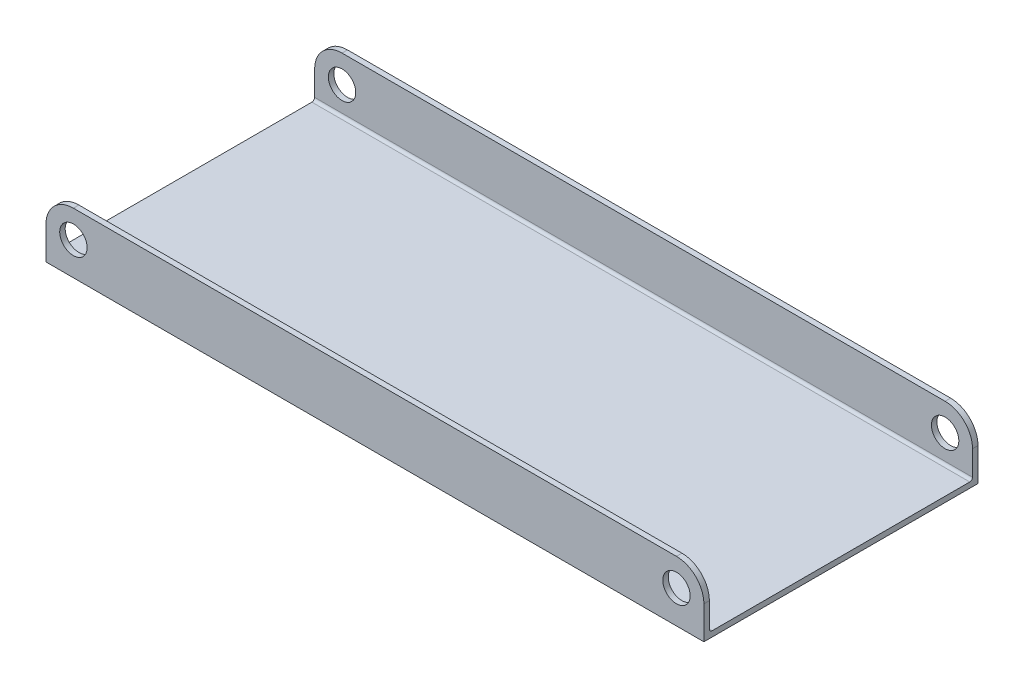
ISO-10303-21;
HEADER;
FILE_DESCRIPTION(('STEP AP214'),'2;1');
FILE_NAME('part.step','',(''),(''),'','','');
FILE_SCHEMA(('AUTOMOTIVE_DESIGN { 1 0 10303 214 1 1 1 1 }'));
ENDSEC;
DATA;
#1=APPLICATION_CONTEXT('core data for automotive mechanical design processes');
#2=APPLICATION_PROTOCOL_DEFINITION('international standard','automotive_design',2000,#1);
#3=PRODUCT_CONTEXT('',#1,'mechanical');
#4=PRODUCT('Part','Part','',(#3));
#5=PRODUCT_RELATED_PRODUCT_CATEGORY('part','',(#4));
#6=PRODUCT_DEFINITION_FORMATION('','',#4);
#7=PRODUCT_DEFINITION_CONTEXT('part definition',#1,'design');
#8=PRODUCT_DEFINITION('design','',#6,#7);
#9=PRODUCT_DEFINITION_SHAPE('','',#8);
#10=(LENGTH_UNIT() NAMED_UNIT(*) SI_UNIT(.MILLI.,.METRE.));
#11=(NAMED_UNIT(*) PLANE_ANGLE_UNIT() SI_UNIT($,.RADIAN.));
#12=(NAMED_UNIT(*) SI_UNIT($,.STERADIAN.) SOLID_ANGLE_UNIT());
#13=UNCERTAINTY_MEASURE_WITH_UNIT(LENGTH_MEASURE(1.E-05),#10,'distance_accuracy_value','');
#14=(GEOMETRIC_REPRESENTATION_CONTEXT(3) GLOBAL_UNCERTAINTY_ASSIGNED_CONTEXT((#13)) GLOBAL_UNIT_ASSIGNED_CONTEXT((#10,
#11,#12)) REPRESENTATION_CONTEXT('',''));
#15=CARTESIAN_POINT('',(0.,0.,0.));
#16=DIRECTION('',(0.,0.,1.));
#17=DIRECTION('',(1.,0.,0.));
#18=AXIS2_PLACEMENT_3D('',#15,#16,#17);
#19=CARTESIAN_POINT('',(0.,1.905,-1.905));
#20=DIRECTION('',(-1.,0.,0.));
#21=DIRECTION('',(0.,0.,1.));
#22=AXIS2_PLACEMENT_3D('',#19,#20,#21);
#23=CYLINDRICAL_SURFACE('',#22,0.635);
#24=DIRECTION('',(1.,0.,0.));
#25=VECTOR('',#24,1.);
#26=CARTESIAN_POINT('',(0.,1.27,-1.905));
#27=LINE('',#26,#25);
#28=CARTESIAN_POINT('',(0.,1.27,-1.905));
#29=VERTEX_POINT('',#28);
#30=CARTESIAN_POINT('',(152.4,1.27,-1.905));
#31=VERTEX_POINT('',#30);
#32=EDGE_CURVE('E193',#29,#31,#27,.T.);
#33=ORIENTED_EDGE('',*,*,#32,.F.);
#34=CARTESIAN_POINT('',(0.,1.905,-1.905));
#35=DIRECTION('',(-1.,0.,0.));
#36=DIRECTION('',(0.,0.,1.));
#37=AXIS2_PLACEMENT_3D('',#34,#35,#36);
#38=CIRCLE('',#37,0.635);
#39=CARTESIAN_POINT('',(0.,1.905,-1.27));
#40=VERTEX_POINT('',#39);
#41=EDGE_CURVE('E44',#29,#40,#38,.T.);
#42=ORIENTED_EDGE('',*,*,#41,.T.);
#43=DIRECTION('',(1.,0.,0.));
#44=VECTOR('',#43,1.);
#45=CARTESIAN_POINT('',(0.,1.905,-1.27));
#46=LINE('',#45,#44);
#47=CARTESIAN_POINT('',(152.4,1.905,-1.27));
#48=VERTEX_POINT('',#47);
#49=EDGE_CURVE('E196',#48,#40,#46,.F.);
#50=ORIENTED_EDGE('',*,*,#49,.F.);
#51=CARTESIAN_POINT('',(152.4,1.905,-1.905));
#52=DIRECTION('',(-1.,0.,0.));
#53=DIRECTION('',(0.,0.,1.));
#54=AXIS2_PLACEMENT_3D('',#51,#52,#53);
#55=CIRCLE('',#54,0.635);
#56=EDGE_CURVE('E11',#48,#31,#55,.F.);
#57=ORIENTED_EDGE('',*,*,#56,.T.);
#58=EDGE_LOOP('',(#33,#42,#50,#57));
#59=FACE_BOUND('',#58,.T.);
#60=ADVANCED_FACE('F37',(#59),#23,.F.);
#61=CARTESIAN_POINT('',(0.,1.905,-61.595));
#62=DIRECTION('',(1.,0.,0.));
#63=DIRECTION('',(0.,0.,-1.));
#64=AXIS2_PLACEMENT_3D('',#61,#62,#63);
#65=CYLINDRICAL_SURFACE('',#64,0.635);
#66=DIRECTION('',(-1.,0.,0.));
#67=VECTOR('',#66,1.);
#68=CARTESIAN_POINT('',(0.,1.27,-61.595));
#69=LINE('',#68,#67);
#70=CARTESIAN_POINT('',(152.4,1.27,-61.595));
#71=VERTEX_POINT('',#70);
#72=CARTESIAN_POINT('',(0.,1.27,-61.595));
#73=VERTEX_POINT('',#72);
#74=EDGE_CURVE('E172',#71,#73,#69,.T.);
#75=ORIENTED_EDGE('',*,*,#74,.F.);
#76=CARTESIAN_POINT('',(152.4,1.905,-61.595));
#77=DIRECTION('',(-1.,0.,0.));
#78=DIRECTION('',(0.,0.,1.));
#79=AXIS2_PLACEMENT_3D('',#76,#77,#78);
#80=CIRCLE('',#79,0.635);
#81=CARTESIAN_POINT('',(152.4,1.905,-62.23));
#82=VERTEX_POINT('',#81);
#83=EDGE_CURVE('E188',#71,#82,#80,.F.);
#84=ORIENTED_EDGE('',*,*,#83,.T.);
#85=DIRECTION('',(-1.,0.,0.));
#86=VECTOR('',#85,1.);
#87=CARTESIAN_POINT('',(0.,1.905,-62.23));
#88=LINE('',#87,#86);
#89=CARTESIAN_POINT('',(0.,1.905,-62.23));
#90=VERTEX_POINT('',#89);
#91=EDGE_CURVE('E185',#90,#82,#88,.F.);
#92=ORIENTED_EDGE('',*,*,#91,.F.);
#93=CARTESIAN_POINT('',(0.,1.905,-61.595));
#94=DIRECTION('',(-1.,0.,0.));
#95=DIRECTION('',(0.,0.,1.));
#96=AXIS2_PLACEMENT_3D('',#93,#94,#95);
#97=CIRCLE('',#96,0.635);
#98=EDGE_CURVE('E190',#90,#73,#97,.T.);
#99=ORIENTED_EDGE('',*,*,#98,.T.);
#100=EDGE_LOOP('',(#75,#84,#92,#99));
#101=FACE_BOUND('',#100,.T.);
#102=ADVANCED_FACE('F297',(#101),#65,.F.);
#103=CARTESIAN_POINT('',(0.,1.27,0.));
#104=DIRECTION('',(0.,0.,-1.));
#105=DIRECTION('',(-1.,0.,0.));
#106=AXIS2_PLACEMENT_3D('',#103,#104,#105);
#107=PLANE('',#106);
#108=CARTESIAN_POINT('',(146.05,7.62,0.));
#109=DIRECTION('',(0.,0.,1.));
#110=DIRECTION('',(1.,0.,0.));
#111=AXIS2_PLACEMENT_3D('',#108,#109,#110);
#112=CIRCLE('',#111,3.175);
#113=CARTESIAN_POINT('',(149.225,7.62,0.));
#114=VERTEX_POINT('',#113);
#115=EDGE_CURVE('E475',#114,#114,#112,.T.);
#116=ORIENTED_EDGE('',*,*,#115,.F.);
#117=EDGE_LOOP('',(#116));
#118=FACE_BOUND('',#117,.T.);
#119=CARTESIAN_POINT('',(6.35,7.62,0.));
#120=DIRECTION('',(0.,0.,1.));
#121=DIRECTION('',(1.,0.,0.));
#122=AXIS2_PLACEMENT_3D('',#119,#120,#121);
#123=CIRCLE('',#122,3.175);
#124=CARTESIAN_POINT('',(9.525,7.62,0.));
#125=VERTEX_POINT('',#124);
#126=EDGE_CURVE('E481',#125,#125,#123,.T.);
#127=ORIENTED_EDGE('',*,*,#126,.F.);
#128=EDGE_LOOP('',(#127));
#129=FACE_BOUND('',#128,.T.);
#130=CARTESIAN_POINT('',(146.05,7.62,0.));
#131=DIRECTION('',(0.,0.,1.));
#132=DIRECTION('',(1.,0.,0.));
#133=AXIS2_PLACEMENT_3D('',#130,#131,#132);
#134=CIRCLE('',#133,6.35);
#135=CARTESIAN_POINT('',(152.4,7.61999999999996,0.));
#136=VERTEX_POINT('',#135);
#137=CARTESIAN_POINT('',(146.05,13.97,0.));
#138=VERTEX_POINT('',#137);
#139=EDGE_CURVE('E156',#136,#138,#134,.T.);
#140=ORIENTED_EDGE('',*,*,#139,.T.);
#141=DIRECTION('',(1.,0.,0.));
#142=VECTOR('',#141,1.);
#143=CARTESIAN_POINT('',(0.,13.97,0.));
#144=LINE('',#143,#142);
#145=CARTESIAN_POINT('',(6.35000000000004,13.97,0.));
#146=VERTEX_POINT('',#145);
#147=EDGE_CURVE('E216',#146,#138,#144,.T.);
#148=ORIENTED_EDGE('',*,*,#147,.F.);
#149=CARTESIAN_POINT('',(6.35,7.62,0.));
#150=DIRECTION('',(0.,0.,1.));
#151=DIRECTION('',(1.,0.,0.));
#152=AXIS2_PLACEMENT_3D('',#149,#150,#151);
#153=CIRCLE('',#152,6.35);
#154=CARTESIAN_POINT('',(0.,7.61999999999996,0.));
#155=VERTEX_POINT('',#154);
#156=EDGE_CURVE('E269',#155,#146,#153,.F.);
#157=ORIENTED_EDGE('',*,*,#156,.F.);
#158=DIRECTION('',(0.,-1.,0.));
#159=VECTOR('',#158,1.);
#160=CARTESIAN_POINT('',(0.,1.27,0.));
#161=LINE('',#160,#159);
#162=CARTESIAN_POINT('',(0.,0.,0.));
#163=VERTEX_POINT('',#162);
#164=EDGE_CURVE('E165',#155,#163,#161,.T.);
#165=ORIENTED_EDGE('',*,*,#164,.T.);
#166=DIRECTION('',(1.,0.,0.));
#167=VECTOR('',#166,1.);
#168=CARTESIAN_POINT('',(0.,0.,0.));
#169=LINE('',#168,#167);
#170=CARTESIAN_POINT('',(152.4,0.,0.));
#171=VERTEX_POINT('',#170);
#172=EDGE_CURVE('E214',#163,#171,#169,.T.);
#173=ORIENTED_EDGE('',*,*,#172,.T.);
#174=DIRECTION('',(0.,-1.,0.));
#175=VECTOR('',#174,1.);
#176=CARTESIAN_POINT('',(152.4,1.27,0.));
#177=LINE('',#176,#175);
#178=EDGE_CURVE('E162',#136,#171,#177,.T.);
#179=ORIENTED_EDGE('',*,*,#178,.F.);
#180=EDGE_LOOP('',(#140,#148,#157,#165,#173,#179));
#181=FACE_BOUND('',#180,.T.);
#182=ADVANCED_FACE('F268',(#118,#129,#181),#107,.F.);
#183=CARTESIAN_POINT('',(0.,1.27,-63.5));
#184=DIRECTION('',(0.,0.,-1.));
#185=DIRECTION('',(-1.,0.,0.));
#186=AXIS2_PLACEMENT_3D('',#183,#184,#185);
#187=PLANE('',#186);
#188=CARTESIAN_POINT('',(146.05,7.62,-63.5));
#189=DIRECTION('',(0.,0.,1.));
#190=DIRECTION('',(1.,0.,0.));
#191=AXIS2_PLACEMENT_3D('',#188,#189,#190);
#192=CIRCLE('',#191,3.175);
#193=CARTESIAN_POINT('',(149.225,7.62,-63.5));
#194=VERTEX_POINT('',#193);
#195=EDGE_CURVE('E182',#194,#194,#192,.T.);
#196=ORIENTED_EDGE('',*,*,#195,.T.);
#197=EDGE_LOOP('',(#196));
#198=FACE_BOUND('',#197,.T.);
#199=CARTESIAN_POINT('',(6.35,7.62,-63.5));
#200=DIRECTION('',(0.,0.,1.));
#201=DIRECTION('',(1.,0.,0.));
#202=AXIS2_PLACEMENT_3D('',#199,#200,#201);
#203=CIRCLE('',#202,3.175);
#204=CARTESIAN_POINT('',(9.525,7.62,-63.5));
#205=VERTEX_POINT('',#204);
#206=EDGE_CURVE('E177',#205,#205,#203,.T.);
#207=ORIENTED_EDGE('',*,*,#206,.T.);
#208=EDGE_LOOP('',(#207));
#209=FACE_BOUND('',#208,.T.);
#210=DIRECTION('',(1.,0.,0.));
#211=VECTOR('',#210,1.);
#212=CARTESIAN_POINT('',(0.,13.97,-63.5));
#213=LINE('',#212,#211);
#214=CARTESIAN_POINT('',(6.35000000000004,13.97,-63.5));
#215=VERTEX_POINT('',#214);
#216=CARTESIAN_POINT('',(146.05,13.97,-63.5));
#217=VERTEX_POINT('',#216);
#218=EDGE_CURVE('E155',#215,#217,#213,.T.);
#219=ORIENTED_EDGE('',*,*,#218,.T.);
#220=CARTESIAN_POINT('',(146.05,7.62,-63.5));
#221=DIRECTION('',(0.,0.,1.));
#222=DIRECTION('',(1.,0.,0.));
#223=AXIS2_PLACEMENT_3D('',#220,#221,#222);
#224=CIRCLE('',#223,6.35);
#225=CARTESIAN_POINT('',(152.4,7.61999999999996,-63.5));
#226=VERTEX_POINT('',#225);
#227=EDGE_CURVE('E137',#226,#217,#224,.T.);
#228=ORIENTED_EDGE('',*,*,#227,.F.);
#229=DIRECTION('',(0.,-1.,0.));
#230=VECTOR('',#229,1.);
#231=CARTESIAN_POINT('',(152.4,1.27,-63.5));
#232=LINE('',#231,#230);
#233=CARTESIAN_POINT('',(152.4,0.,-63.5));
#234=VERTEX_POINT('',#233);
#235=EDGE_CURVE('E151',#226,#234,#232,.T.);
#236=ORIENTED_EDGE('',*,*,#235,.T.);
#237=DIRECTION('',(1.,0.,0.));
#238=VECTOR('',#237,1.);
#239=CARTESIAN_POINT('',(0.,0.,-63.5));
#240=LINE('',#239,#238);
#241=CARTESIAN_POINT('',(0.,0.,-63.5));
#242=VERTEX_POINT('',#241);
#243=EDGE_CURVE('E222',#242,#234,#240,.T.);
#244=ORIENTED_EDGE('',*,*,#243,.F.);
#245=DIRECTION('',(0.,-1.,0.));
#246=VECTOR('',#245,1.);
#247=CARTESIAN_POINT('',(0.,1.27,-63.5));
#248=LINE('',#247,#246);
#249=CARTESIAN_POINT('',(0.,7.61999999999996,-63.5));
#250=VERTEX_POINT('',#249);
#251=EDGE_CURVE('E163',#250,#242,#248,.T.);
#252=ORIENTED_EDGE('',*,*,#251,.F.);
#253=CARTESIAN_POINT('',(6.35,7.62,-63.5));
#254=DIRECTION('',(0.,0.,1.));
#255=DIRECTION('',(1.,0.,0.));
#256=AXIS2_PLACEMENT_3D('',#253,#254,#255);
#257=CIRCLE('',#256,6.35);
#258=EDGE_CURVE('E231',#250,#215,#257,.F.);
#259=ORIENTED_EDGE('',*,*,#258,.T.);
#260=EDGE_LOOP('',(#219,#228,#236,#244,#252,#259));
#261=FACE_BOUND('',#260,.T.);
#262=ADVANCED_FACE('F149',(#198,#209,#261),#187,.T.);
#263=CARTESIAN_POINT('',(0.,13.97,-1.27));
#264=DIRECTION('',(0.,0.,-1.));
#265=DIRECTION('',(-1.,0.,0.));
#266=AXIS2_PLACEMENT_3D('',#263,#264,#265);
#267=PLANE('',#266);
#268=CARTESIAN_POINT('',(146.05,7.62,-1.27));
#269=DIRECTION('',(0.,0.,-1.));
#270=DIRECTION('',(-1.,0.,0.));
#271=AXIS2_PLACEMENT_3D('',#268,#269,#270);
#272=CIRCLE('',#271,3.175);
#273=CARTESIAN_POINT('',(142.875,7.62,-1.27));
#274=VERTEX_POINT('',#273);
#275=EDGE_CURVE('E181',#274,#274,#272,.T.);
#276=ORIENTED_EDGE('',*,*,#275,.F.);
#277=EDGE_LOOP('',(#276));
#278=FACE_BOUND('',#277,.T.);
#279=CARTESIAN_POINT('',(6.35,7.62,-1.27));
#280=DIRECTION('',(0.,0.,-1.));
#281=DIRECTION('',(-1.,0.,0.));
#282=AXIS2_PLACEMENT_3D('',#279,#280,#281);
#283=CIRCLE('',#282,3.175);
#284=CARTESIAN_POINT('',(3.175,7.62,-1.27));
#285=VERTEX_POINT('',#284);
#286=EDGE_CURVE('E176',#285,#285,#283,.T.);
#287=ORIENTED_EDGE('',*,*,#286,.F.);
#288=EDGE_LOOP('',(#287));
#289=FACE_BOUND('',#288,.T.);
#290=DIRECTION('',(0.,-1.,0.));
#291=VECTOR('',#290,1.);
#292=CARTESIAN_POINT('',(152.4,13.97,-1.27));
#293=LINE('',#292,#291);
#294=CARTESIAN_POINT('',(152.4,7.61999999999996,-1.27));
#295=VERTEX_POINT('',#294);
#296=EDGE_CURVE('E205',#295,#48,#293,.T.);
#297=ORIENTED_EDGE('',*,*,#296,.T.);
#298=ORIENTED_EDGE('',*,*,#49,.T.);
#299=DIRECTION('',(0.,-1.,0.));
#300=VECTOR('',#299,1.);
#301=CARTESIAN_POINT('',(0.,13.97,-1.27));
#302=LINE('',#301,#300);
#303=CARTESIAN_POINT('',(0.,7.61999999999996,-1.27));
#304=VERTEX_POINT('',#303);
#305=EDGE_CURVE('E203',#304,#40,#302,.T.);
#306=ORIENTED_EDGE('',*,*,#305,.F.);
#307=CARTESIAN_POINT('',(6.35,7.62,-1.27));
#308=DIRECTION('',(0.,0.,-1.));
#309=DIRECTION('',(-1.,0.,0.));
#310=AXIS2_PLACEMENT_3D('',#307,#308,#309);
#311=CIRCLE('',#310,6.35);
#312=CARTESIAN_POINT('',(6.35000000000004,13.97,-1.27));
#313=VERTEX_POINT('',#312);
#314=EDGE_CURVE('E249',#313,#304,#311,.F.);
#315=ORIENTED_EDGE('',*,*,#314,.F.);
#316=DIRECTION('',(1.,0.,0.));
#317=VECTOR('',#316,1.);
#318=CARTESIAN_POINT('',(0.,13.97,-1.27));
#319=LINE('',#318,#317);
#320=CARTESIAN_POINT('',(146.05,13.97,-1.27));
#321=VERTEX_POINT('',#320);
#322=EDGE_CURVE('E257',#313,#321,#319,.T.);
#323=ORIENTED_EDGE('',*,*,#322,.T.);
#324=CARTESIAN_POINT('',(146.05,7.62,-1.27));
#325=DIRECTION('',(0.,0.,-1.));
#326=DIRECTION('',(-1.,0.,0.));
#327=AXIS2_PLACEMENT_3D('',#324,#325,#326);
#328=CIRCLE('',#327,6.35);
#329=EDGE_CURVE('E280',#321,#295,#328,.T.);
#330=ORIENTED_EDGE('',*,*,#329,.T.);
#331=EDGE_LOOP('',(#297,#298,#306,#315,#323,#330));
#332=FACE_BOUND('',#331,.T.);
#333=ADVANCED_FACE('F201',(#278,#289,#332),#267,.T.);
#334=CARTESIAN_POINT('',(0.,13.97,-62.23));
#335=DIRECTION('',(0.,0.,1.));
#336=DIRECTION('',(1.,0.,0.));
#337=AXIS2_PLACEMENT_3D('',#334,#335,#336);
#338=PLANE('',#337);
#339=CARTESIAN_POINT('',(146.05,7.62,-62.23));
#340=DIRECTION('',(0.,0.,1.));
#341=DIRECTION('',(1.,0.,0.));
#342=AXIS2_PLACEMENT_3D('',#339,#340,#341);
#343=CIRCLE('',#342,3.175);
#344=CARTESIAN_POINT('',(149.225,7.62,-62.23));
#345=VERTEX_POINT('',#344);
#346=EDGE_CURVE('E178',#345,#345,#343,.T.);
#347=ORIENTED_EDGE('',*,*,#346,.F.);
#348=EDGE_LOOP('',(#347));
#349=FACE_BOUND('',#348,.T.);
#350=CARTESIAN_POINT('',(6.35,7.62,-62.23));
#351=DIRECTION('',(0.,0.,1.));
#352=DIRECTION('',(1.,0.,0.));
#353=AXIS2_PLACEMENT_3D('',#350,#351,#352);
#354=CIRCLE('',#353,3.175);
#355=CARTESIAN_POINT('',(9.525,7.62,-62.23));
#356=VERTEX_POINT('',#355);
#357=EDGE_CURVE('E173',#356,#356,#354,.T.);
#358=ORIENTED_EDGE('',*,*,#357,.F.);
#359=EDGE_LOOP('',(#358));
#360=FACE_BOUND('',#359,.T.);
#361=DIRECTION('',(0.,-1.,0.));
#362=VECTOR('',#361,1.);
#363=CARTESIAN_POINT('',(0.,13.97,-62.23));
#364=LINE('',#363,#362);
#365=CARTESIAN_POINT('',(0.,7.61999999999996,-62.23));
#366=VERTEX_POINT('',#365);
#367=EDGE_CURVE('E236',#366,#90,#364,.T.);
#368=ORIENTED_EDGE('',*,*,#367,.T.);
#369=ORIENTED_EDGE('',*,*,#91,.T.);
#370=DIRECTION('',(0.,-1.,0.));
#371=VECTOR('',#370,1.);
#372=CARTESIAN_POINT('',(152.4,13.97,-62.23));
#373=LINE('',#372,#371);
#374=CARTESIAN_POINT('',(152.4,7.61999999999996,-62.23));
#375=VERTEX_POINT('',#374);
#376=EDGE_CURVE('E255',#375,#82,#373,.T.);
#377=ORIENTED_EDGE('',*,*,#376,.F.);
#378=CARTESIAN_POINT('',(146.05,7.62,-62.23));
#379=DIRECTION('',(0.,0.,1.));
#380=DIRECTION('',(1.,0.,0.));
#381=AXIS2_PLACEMENT_3D('',#378,#379,#380);
#382=CIRCLE('',#381,6.35);
#383=CARTESIAN_POINT('',(146.05,13.97,-62.23));
#384=VERTEX_POINT('',#383);
#385=EDGE_CURVE('E140',#375,#384,#382,.T.);
#386=ORIENTED_EDGE('',*,*,#385,.T.);
#387=DIRECTION('',(-1.,0.,0.));
#388=VECTOR('',#387,1.);
#389=CARTESIAN_POINT('',(0.,13.97,-62.23));
#390=LINE('',#389,#388);
#391=CARTESIAN_POINT('',(6.35,13.97,-62.23));
#392=VERTEX_POINT('',#391);
#393=EDGE_CURVE('E251',#384,#392,#390,.T.);
#394=ORIENTED_EDGE('',*,*,#393,.T.);
#395=CARTESIAN_POINT('',(6.35,7.62,-62.23));
#396=DIRECTION('',(0.,0.,1.));
#397=DIRECTION('',(1.,0.,0.));
#398=AXIS2_PLACEMENT_3D('',#395,#396,#397);
#399=CIRCLE('',#398,6.35);
#400=EDGE_CURVE('E247',#366,#392,#399,.F.);
#401=ORIENTED_EDGE('',*,*,#400,.F.);
#402=EDGE_LOOP('',(#368,#369,#377,#386,#394,#401));
#403=FACE_BOUND('',#402,.T.);
#404=ADVANCED_FACE('F309',(#349,#360,#403),#338,.T.);
#405=CARTESIAN_POINT('',(0.,1.27,0.));
#406=DIRECTION('',(-1.,0.,0.));
#407=DIRECTION('',(0.,0.,1.));
#408=AXIS2_PLACEMENT_3D('',#405,#406,#407);
#409=PLANE('',#408);
#410=ORIENTED_EDGE('',*,*,#41,.F.);
#411=DIRECTION('',(0.,0.,-1.));
#412=VECTOR('',#411,1.);
#413=CARTESIAN_POINT('',(0.,1.27,0.));
#414=LINE('',#413,#412);
#415=EDGE_CURVE('E220',#29,#73,#414,.T.);
#416=ORIENTED_EDGE('',*,*,#415,.T.);
#417=ORIENTED_EDGE('',*,*,#98,.F.);
#418=ORIENTED_EDGE('',*,*,#367,.F.);
#419=DIRECTION('',(0.,0.,1.));
#420=VECTOR('',#419,1.);
#421=CARTESIAN_POINT('',(0.,7.61999999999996,-63.5));
#422=LINE('',#421,#420);
#423=EDGE_CURVE('E234',#250,#366,#422,.T.);
#424=ORIENTED_EDGE('',*,*,#423,.F.);
#425=ORIENTED_EDGE('',*,*,#251,.T.);
#426=DIRECTION('',(0.,0.,-1.));
#427=VECTOR('',#426,1.);
#428=CARTESIAN_POINT('',(0.,0.,0.));
#429=LINE('',#428,#427);
#430=EDGE_CURVE('E211',#163,#242,#429,.T.);
#431=ORIENTED_EDGE('',*,*,#430,.F.);
#432=ORIENTED_EDGE('',*,*,#164,.F.);
#433=EDGE_CURVE('E210',#304,#155,#422,.T.);
#434=ORIENTED_EDGE('',*,*,#433,.F.);
#435=ORIENTED_EDGE('',*,*,#305,.T.);
#436=EDGE_LOOP('',(#410,#416,#417,#418,#424,#425,#431,#432,#434,#435));
#437=FACE_BOUND('',#436,.T.);
#438=ADVANCED_FACE('F208',(#437),#409,.T.);
#439=CARTESIAN_POINT('',(152.4,1.27,0.));
#440=DIRECTION('',(-1.,0.,0.));
#441=DIRECTION('',(0.,0.,1.));
#442=AXIS2_PLACEMENT_3D('',#439,#440,#441);
#443=PLANE('',#442);
#444=ORIENTED_EDGE('',*,*,#235,.F.);
#445=DIRECTION('',(0.,0.,1.));
#446=VECTOR('',#445,1.);
#447=CARTESIAN_POINT('',(152.4,7.61999999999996,-63.5));
#448=LINE('',#447,#446);
#449=EDGE_CURVE('E134',#226,#375,#448,.T.);
#450=ORIENTED_EDGE('',*,*,#449,.T.);
#451=ORIENTED_EDGE('',*,*,#376,.T.);
#452=ORIENTED_EDGE('',*,*,#83,.F.);
#453=DIRECTION('',(0.,0.,-1.));
#454=VECTOR('',#453,1.);
#455=CARTESIAN_POINT('',(152.4,1.27,0.));
#456=LINE('',#455,#454);
#457=EDGE_CURVE('E167',#31,#71,#456,.T.);
#458=ORIENTED_EDGE('',*,*,#457,.F.);
#459=ORIENTED_EDGE('',*,*,#56,.F.);
#460=ORIENTED_EDGE('',*,*,#296,.F.);
#461=EDGE_CURVE('E145',#295,#136,#448,.T.);
#462=ORIENTED_EDGE('',*,*,#461,.T.);
#463=ORIENTED_EDGE('',*,*,#178,.T.);
#464=DIRECTION('',(0.,0.,-1.));
#465=VECTOR('',#464,1.);
#466=CARTESIAN_POINT('',(152.4,0.,0.));
#467=LINE('',#466,#465);
#468=EDGE_CURVE('E160',#171,#234,#467,.T.);
#469=ORIENTED_EDGE('',*,*,#468,.T.);
#470=EDGE_LOOP('',(#444,#450,#451,#452,#458,#459,#460,#462,#463,#469));
#471=FACE_BOUND('',#470,.T.);
#472=ADVANCED_FACE('F158',(#471),#443,.F.);
#473=CARTESIAN_POINT('',(0.,1.27,0.));
#474=DIRECTION('',(0.,1.,0.));
#475=DIRECTION('',(0.,0.,1.));
#476=AXIS2_PLACEMENT_3D('',#473,#474,#475);
#477=PLANE('',#476);
#478=ORIENTED_EDGE('',*,*,#415,.F.);
#479=ORIENTED_EDGE('',*,*,#32,.T.);
#480=ORIENTED_EDGE('',*,*,#457,.T.);
#481=ORIENTED_EDGE('',*,*,#74,.T.);
#482=EDGE_LOOP('',(#478,#479,#480,#481));
#483=FACE_BOUND('',#482,.T.);
#484=ADVANCED_FACE('F304',(#483),#477,.T.);
#485=CARTESIAN_POINT('',(0.,0.,0.));
#486=DIRECTION('',(0.,1.,0.));
#487=DIRECTION('',(0.,0.,1.));
#488=AXIS2_PLACEMENT_3D('',#485,#486,#487);
#489=PLANE('',#488);
#490=ORIENTED_EDGE('',*,*,#430,.T.);
#491=ORIENTED_EDGE('',*,*,#243,.T.);
#492=ORIENTED_EDGE('',*,*,#468,.F.);
#493=ORIENTED_EDGE('',*,*,#172,.F.);
#494=EDGE_LOOP('',(#490,#491,#492,#493));
#495=FACE_BOUND('',#494,.T.);
#496=ADVANCED_FACE('F227',(#495),#489,.F.);
#497=CARTESIAN_POINT('',(0.,13.97,0.));
#498=DIRECTION('',(0.,1.,0.));
#499=DIRECTION('',(0.,0.,1.));
#500=AXIS2_PLACEMENT_3D('',#497,#498,#499);
#501=PLANE('',#500);
#502=DIRECTION('',(0.,0.,1.));
#503=VECTOR('',#502,1.);
#504=CARTESIAN_POINT('',(146.05,13.97,-63.5));
#505=LINE('',#504,#503);
#506=EDGE_CURVE('E144',#321,#138,#505,.T.);
#507=ORIENTED_EDGE('',*,*,#506,.F.);
#508=ORIENTED_EDGE('',*,*,#322,.F.);
#509=DIRECTION('',(0.,0.,1.));
#510=VECTOR('',#509,1.);
#511=CARTESIAN_POINT('',(6.35000000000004,13.97,-63.5));
#512=LINE('',#511,#510);
#513=EDGE_CURVE('E240',#313,#146,#512,.T.);
#514=ORIENTED_EDGE('',*,*,#513,.T.);
#515=ORIENTED_EDGE('',*,*,#147,.T.);
#516=EDGE_LOOP('',(#507,#508,#514,#515));
#517=FACE_BOUND('',#516,.T.);
#518=ADVANCED_FACE('F263',(#517),#501,.T.);
#519=CARTESIAN_POINT('',(0.,13.97,0.));
#520=DIRECTION('',(0.,1.,0.));
#521=DIRECTION('',(0.,0.,1.));
#522=AXIS2_PLACEMENT_3D('',#519,#520,#521);
#523=PLANE('',#522);
#524=EDGE_CURVE('E277',#217,#384,#505,.T.);
#525=ORIENTED_EDGE('',*,*,#524,.F.);
#526=ORIENTED_EDGE('',*,*,#218,.F.);
#527=EDGE_CURVE('E243',#215,#392,#512,.T.);
#528=ORIENTED_EDGE('',*,*,#527,.T.);
#529=ORIENTED_EDGE('',*,*,#393,.F.);
#530=EDGE_LOOP('',(#525,#526,#528,#529));
#531=FACE_BOUND('',#530,.T.);
#532=ADVANCED_FACE('F314',(#531),#523,.T.);
#533=CARTESIAN_POINT('',(6.35,7.62,-63.5));
#534=DIRECTION('',(0.,0.,1.));
#535=DIRECTION('',(1.,0.,0.));
#536=AXIS2_PLACEMENT_3D('',#533,#534,#535);
#537=CYLINDRICAL_SURFACE('',#536,6.35);
#538=ORIENTED_EDGE('',*,*,#400,.T.);
#539=ORIENTED_EDGE('',*,*,#527,.F.);
#540=ORIENTED_EDGE('',*,*,#258,.F.);
#541=ORIENTED_EDGE('',*,*,#423,.T.);
#542=EDGE_LOOP('',(#538,#539,#540,#541));
#543=FACE_BOUND('',#542,.T.);
#544=ADVANCED_FACE('F312',(#543),#537,.T.);
#545=ORIENTED_EDGE('',*,*,#314,.T.);
#546=ORIENTED_EDGE('',*,*,#433,.T.);
#547=ORIENTED_EDGE('',*,*,#156,.T.);
#548=ORIENTED_EDGE('',*,*,#513,.F.);
#549=EDGE_LOOP('',(#545,#546,#547,#548));
#550=FACE_BOUND('',#549,.T.);
#551=ADVANCED_FACE('F283',(#550),#537,.T.);
#552=CARTESIAN_POINT('',(146.05,7.62,-63.5));
#553=DIRECTION('',(0.,0.,1.));
#554=DIRECTION('',(1.,0.,0.));
#555=AXIS2_PLACEMENT_3D('',#552,#553,#554);
#556=CYLINDRICAL_SURFACE('',#555,6.35);
#557=ORIENTED_EDGE('',*,*,#449,.F.);
#558=ORIENTED_EDGE('',*,*,#227,.T.);
#559=ORIENTED_EDGE('',*,*,#524,.T.);
#560=ORIENTED_EDGE('',*,*,#385,.F.);
#561=EDGE_LOOP('',(#557,#558,#559,#560));
#562=FACE_BOUND('',#561,.T.);
#563=ADVANCED_FACE('F136',(#562),#556,.T.);
#564=ORIENTED_EDGE('',*,*,#506,.T.);
#565=ORIENTED_EDGE('',*,*,#139,.F.);
#566=ORIENTED_EDGE('',*,*,#461,.F.);
#567=ORIENTED_EDGE('',*,*,#329,.F.);
#568=EDGE_LOOP('',(#564,#565,#566,#567));
#569=FACE_BOUND('',#568,.T.);
#570=ADVANCED_FACE('F284',(#569),#556,.T.);
#571=CARTESIAN_POINT('',(6.35,7.62,-63.5));
#572=DIRECTION('',(0.,0.,1.));
#573=DIRECTION('',(1.,0.,0.));
#574=AXIS2_PLACEMENT_3D('',#571,#572,#573);
#575=CYLINDRICAL_SURFACE('',#574,3.175);
#576=ORIENTED_EDGE('',*,*,#357,.T.);
#577=EDGE_LOOP('',(#576));
#578=FACE_BOUND('',#577,.T.);
#579=ORIENTED_EDGE('',*,*,#206,.F.);
#580=EDGE_LOOP('',(#579));
#581=FACE_BOUND('',#580,.T.);
#582=ADVANCED_FACE('F286',(#578,#581),#575,.F.);
#583=ORIENTED_EDGE('',*,*,#286,.T.);
#584=EDGE_LOOP('',(#583));
#585=FACE_BOUND('',#584,.T.);
#586=ORIENTED_EDGE('',*,*,#126,.T.);
#587=EDGE_LOOP('',(#586));
#588=FACE_BOUND('',#587,.T.);
#589=ADVANCED_FACE('F292',(#585,#588),#575,.F.);
#590=CARTESIAN_POINT('',(146.05,7.62,-63.5));
#591=DIRECTION('',(0.,0.,1.));
#592=DIRECTION('',(1.,0.,0.));
#593=AXIS2_PLACEMENT_3D('',#590,#591,#592);
#594=CYLINDRICAL_SURFACE('',#593,3.175);
#595=ORIENTED_EDGE('',*,*,#346,.T.);
#596=EDGE_LOOP('',(#595));
#597=FACE_BOUND('',#596,.T.);
#598=ORIENTED_EDGE('',*,*,#195,.F.);
#599=EDGE_LOOP('',(#598));
#600=FACE_BOUND('',#599,.T.);
#601=ADVANCED_FACE('F420',(#597,#600),#594,.F.);
#602=ORIENTED_EDGE('',*,*,#275,.T.);
#603=EDGE_LOOP('',(#602));
#604=FACE_BOUND('',#603,.T.);
#605=ORIENTED_EDGE('',*,*,#115,.T.);
#606=EDGE_LOOP('',(#605));
#607=FACE_BOUND('',#606,.T.);
#608=ADVANCED_FACE('F429',(#604,#607),#594,.F.);
#609=CLOSED_SHELL('',(#60,#102,#182,#262,#333,#404,#438,#472,#484,#496,#518,#532,#544,#551,#563,
#570,#582,#589,#601,#608));
#610=MANIFOLD_SOLID_BREP('B2',#609);
#611=ADVANCED_BREP_SHAPE_REPRESENTATION('',(#18,#610),#14);
#612=SHAPE_DEFINITION_REPRESENTATION(#9,#611);
ENDSEC;
END-ISO-10303-21;
